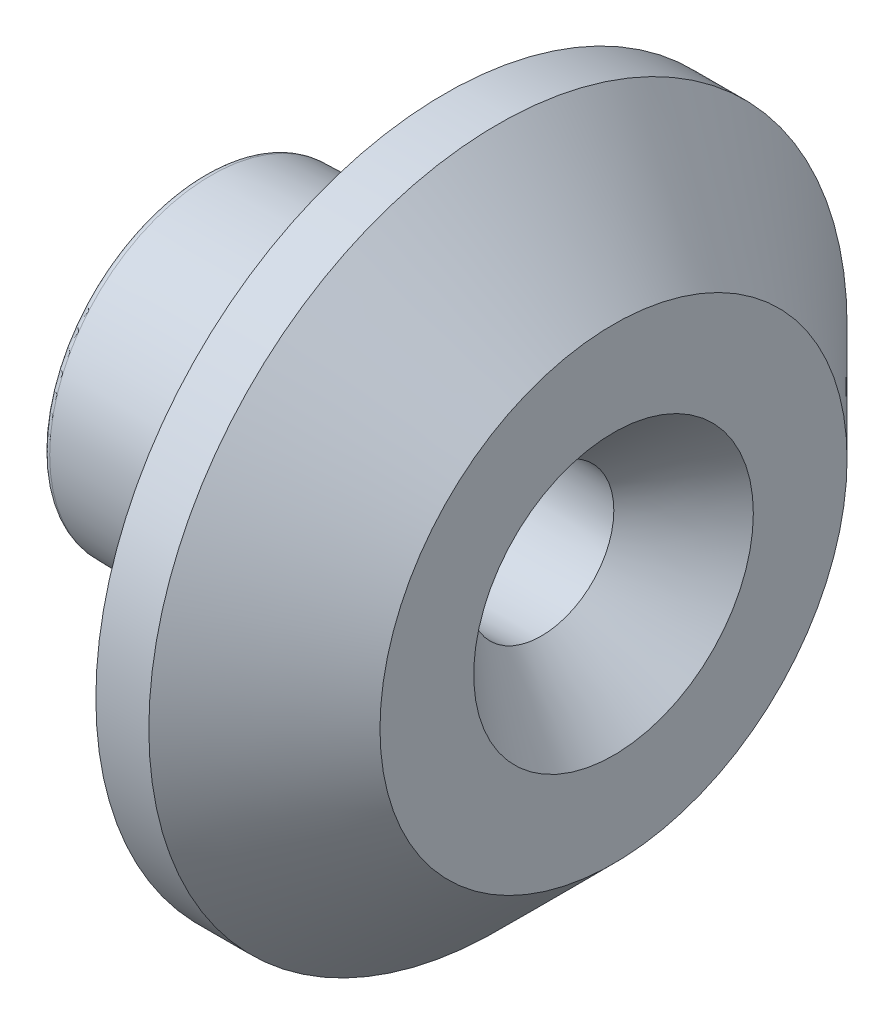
ISO-10303-21;
HEADER;
FILE_DESCRIPTION(('STEP AP214'),'2;1');
FILE_NAME('part.step','',(''),(''),'','','');
FILE_SCHEMA(('AUTOMOTIVE_DESIGN { 1 0 10303 214 1 1 1 1 }'));
ENDSEC;
DATA;
#1=APPLICATION_CONTEXT('core data for automotive mechanical design processes');
#2=APPLICATION_PROTOCOL_DEFINITION('international standard','automotive_design',2000,#1);
#3=PRODUCT_CONTEXT('',#1,'mechanical');
#4=PRODUCT('Part','Part','',(#3));
#5=PRODUCT_RELATED_PRODUCT_CATEGORY('part','',(#4));
#6=PRODUCT_DEFINITION_FORMATION('','',#4);
#7=PRODUCT_DEFINITION_CONTEXT('part definition',#1,'design');
#8=PRODUCT_DEFINITION('design','',#6,#7);
#9=PRODUCT_DEFINITION_SHAPE('','',#8);
#10=(LENGTH_UNIT() NAMED_UNIT(*) SI_UNIT(.MILLI.,.METRE.));
#11=(NAMED_UNIT(*) PLANE_ANGLE_UNIT() SI_UNIT($,.RADIAN.));
#12=(NAMED_UNIT(*) SI_UNIT($,.STERADIAN.) SOLID_ANGLE_UNIT());
#13=UNCERTAINTY_MEASURE_WITH_UNIT(LENGTH_MEASURE(1.E-05),#10,'distance_accuracy_value','');
#14=(GEOMETRIC_REPRESENTATION_CONTEXT(3) GLOBAL_UNCERTAINTY_ASSIGNED_CONTEXT((#13)) GLOBAL_UNIT_ASSIGNED_CONTEXT((#10,
#11,#12)) REPRESENTATION_CONTEXT('',''));
#15=CARTESIAN_POINT('',(0.,0.,0.));
#16=DIRECTION('',(0.,0.,1.));
#17=DIRECTION('',(1.,0.,0.));
#18=AXIS2_PLACEMENT_3D('',#15,#16,#17);
#19=CARTESIAN_POINT('',(0.,7.105,0.));
#20=DIRECTION('',(1.,0.,0.));
#21=DIRECTION('',(0.,0.,-1.));
#22=AXIS2_PLACEMENT_3D('',#19,#20,#21);
#23=PLANE('',#22);
#24=CARTESIAN_POINT('',(0.,0.,0.));
#25=DIRECTION('',(-1.,0.,0.));
#26=DIRECTION('',(0.,0.,1.));
#27=AXIS2_PLACEMENT_3D('',#24,#25,#26);
#28=CIRCLE('',#27,14.7175);
#29=CARTESIAN_POINT('',(0.,0.,14.7175));
#30=VERTEX_POINT('',#29);
#31=EDGE_CURVE('E69',#30,#30,#28,.T.);
#32=ORIENTED_EDGE('',*,*,#31,.T.);
#33=EDGE_LOOP('',(#32));
#34=FACE_BOUND('',#33,.T.);
#35=CARTESIAN_POINT('',(0.,0.,0.));
#36=DIRECTION('',(-1.,0.,0.));
#37=DIRECTION('',(0.,0.,1.));
#38=AXIS2_PLACEMENT_3D('',#35,#36,#37);
#39=CIRCLE('',#38,12.18);
#40=CARTESIAN_POINT('',(0.,0.,12.18));
#41=VERTEX_POINT('',#40);
#42=EDGE_CURVE('E78',#41,#41,#39,.T.);
#43=ORIENTED_EDGE('',*,*,#42,.F.);
#44=EDGE_LOOP('',(#43));
#45=FACE_BOUND('',#44,.T.);
#46=ADVANCED_FACE('F31',(#34,#45),#23,.F.);
#47=CARTESIAN_POINT('',(-65.7098157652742,0.,0.));
#48=DIRECTION('',(-1.,0.,0.));
#49=DIRECTION('',(0.,0.,1.));
#50=AXIS2_PLACEMENT_3D('',#47,#48,#49);
#51=CYLINDRICAL_SURFACE('',#50,14.7175);
#52=ORIENTED_EDGE('',*,*,#31,.F.);
#53=EDGE_LOOP('',(#52));
#54=FACE_BOUND('',#53,.T.);
#55=CARTESIAN_POINT('',(2.23299999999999,0.,0.));
#56=DIRECTION('',(-1.,0.,0.));
#57=DIRECTION('',(0.,0.,1.));
#58=AXIS2_PLACEMENT_3D('',#55,#56,#57);
#59=CIRCLE('',#58,14.7175);
#60=CARTESIAN_POINT('',(2.23299999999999,0.,14.7175));
#61=VERTEX_POINT('',#60);
#62=EDGE_CURVE('E72',#61,#61,#59,.T.);
#63=ORIENTED_EDGE('',*,*,#62,.T.);
#64=EDGE_LOOP('',(#63));
#65=FACE_BOUND('',#64,.T.);
#66=ADVANCED_FACE('F104',(#54,#65),#51,.T.);
#67=CARTESIAN_POINT('',(7.10499999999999,0.,0.));
#68=DIRECTION('',(-1.,0.,0.));
#69=DIRECTION('',(0.,0.,1.));
#70=AXIS2_PLACEMENT_3D('',#67,#68,#69);
#71=CONICAL_SURFACE('',#70,9.84549999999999,0.78539816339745);
#72=ORIENTED_EDGE('',*,*,#62,.F.);
#73=EDGE_LOOP('',(#72));
#74=FACE_BOUND('',#73,.T.);
#75=CARTESIAN_POINT('',(7.10499999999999,0.,0.));
#76=DIRECTION('',(-1.,0.,0.));
#77=DIRECTION('',(0.,0.,1.));
#78=AXIS2_PLACEMENT_3D('',#75,#76,#77);
#79=CIRCLE('',#78,9.84549999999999);
#80=CARTESIAN_POINT('',(7.10499999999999,0.,9.84549999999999));
#81=VERTEX_POINT('',#80);
#82=EDGE_CURVE('E75',#81,#81,#79,.T.);
#83=ORIENTED_EDGE('',*,*,#82,.T.);
#84=EDGE_LOOP('',(#83));
#85=FACE_BOUND('',#84,.T.);
#86=ADVANCED_FACE('F110',(#74,#85),#71,.T.);
#87=CARTESIAN_POINT('',(7.105,9.84549999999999,0.));
#88=DIRECTION('',(-1.,0.,0.));
#89=DIRECTION('',(0.,0.,1.));
#90=AXIS2_PLACEMENT_3D('',#87,#88,#89);
#91=PLANE('',#90);
#92=CARTESIAN_POINT('',(7.105,0.,0.));
#93=DIRECTION('',(-1.,0.,0.));
#94=DIRECTION('',(0.,0.,1.));
#95=AXIS2_PLACEMENT_3D('',#92,#93,#94);
#96=CIRCLE('',#95,5.89398977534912);
#97=CARTESIAN_POINT('',(7.105,0.,-5.89398977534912));
#98=VERTEX_POINT('',#97);
#99=EDGE_CURVE('E38',#98,#98,#96,.T.);
#100=ORIENTED_EDGE('',*,*,#99,.T.);
#101=EDGE_LOOP('',(#100));
#102=FACE_BOUND('',#101,.T.);
#103=ORIENTED_EDGE('',*,*,#82,.F.);
#104=EDGE_LOOP('',(#103));
#105=FACE_BOUND('',#104,.T.);
#106=ADVANCED_FACE('F187',(#102,#105),#91,.F.);
#107=CARTESIAN_POINT('',(-54.0194689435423,0.,0.));
#108=DIRECTION('',(-1.,0.,0.));
#109=DIRECTION('',(0.,0.,1.));
#110=AXIS2_PLACEMENT_3D('',#107,#108,#109);
#111=CYLINDRICAL_SURFACE('',#110,12.18);
#112=CARTESIAN_POINT('',(1.7255,0.,0.));
#113=DIRECTION('',(-1.,0.,0.));
#114=DIRECTION('',(0.,0.,1.));
#115=AXIS2_PLACEMENT_3D('',#112,#113,#114);
#116=CIRCLE('',#115,12.18);
#117=CARTESIAN_POINT('',(1.7255,0.,12.18));
#118=VERTEX_POINT('',#117);
#119=EDGE_CURVE('E51',#118,#118,#116,.F.);
#120=ORIENTED_EDGE('',*,*,#119,.T.);
#121=EDGE_LOOP('',(#120));
#122=FACE_BOUND('',#121,.T.);
#123=ORIENTED_EDGE('',*,*,#42,.T.);
#124=EDGE_LOOP('',(#123));
#125=FACE_BOUND('',#124,.T.);
#126=ADVANCED_FACE('F99',(#122,#125),#111,.F.);
#127=CARTESIAN_POINT('',(2.03,7.105,0.));
#128=DIRECTION('',(-1.,0.,0.));
#129=DIRECTION('',(0.,0.,1.));
#130=AXIS2_PLACEMENT_3D('',#127,#128,#129);
#131=PLANE('',#130);
#132=CARTESIAN_POINT('',(2.03,0.,0.));
#133=DIRECTION('',(-1.,0.,0.));
#134=DIRECTION('',(0.,0.,1.));
#135=AXIS2_PLACEMENT_3D('',#132,#133,#134);
#136=CIRCLE('',#135,7.4095);
#137=CARTESIAN_POINT('',(2.03,0.,7.4095));
#138=VERTEX_POINT('',#137);
#139=EDGE_CURVE('E54',#138,#138,#136,.F.);
#140=ORIENTED_EDGE('',*,*,#139,.T.);
#141=EDGE_LOOP('',(#140));
#142=FACE_BOUND('',#141,.T.);
#143=CARTESIAN_POINT('',(2.03,0.,0.));
#144=DIRECTION('',(-1.,0.,0.));
#145=DIRECTION('',(0.,0.,1.));
#146=AXIS2_PLACEMENT_3D('',#143,#144,#145);
#147=CIRCLE('',#146,11.8755);
#148=CARTESIAN_POINT('',(2.03,0.,11.8755));
#149=VERTEX_POINT('',#148);
#150=EDGE_CURVE('E57',#149,#149,#147,.T.);
#151=ORIENTED_EDGE('',*,*,#150,.T.);
#152=EDGE_LOOP('',(#151));
#153=FACE_BOUND('',#152,.T.);
#154=ADVANCED_FACE('F90',(#142,#153),#131,.T.);
#155=CARTESIAN_POINT('',(-54.0194689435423,0.,0.));
#156=DIRECTION('',(-1.,0.,0.));
#157=DIRECTION('',(0.,0.,1.));
#158=AXIS2_PLACEMENT_3D('',#155,#156,#157);
#159=CYLINDRICAL_SURFACE('',#158,7.105);
#160=CARTESIAN_POINT('',(1.7255,0.,0.));
#161=DIRECTION('',(-1.,0.,0.));
#162=DIRECTION('',(0.,0.,1.));
#163=AXIS2_PLACEMENT_3D('',#160,#161,#162);
#164=CIRCLE('',#163,7.105);
#165=CARTESIAN_POINT('',(1.7255,0.,7.105));
#166=VERTEX_POINT('',#165);
#167=EDGE_CURVE('E60',#166,#166,#164,.T.);
#168=ORIENTED_EDGE('',*,*,#167,.T.);
#169=EDGE_LOOP('',(#168));
#170=FACE_BOUND('',#169,.T.);
#171=CARTESIAN_POINT('',(0.,0.,0.));
#172=DIRECTION('',(-1.,0.,0.));
#173=DIRECTION('',(0.,0.,1.));
#174=AXIS2_PLACEMENT_3D('',#171,#172,#173);
#175=CIRCLE('',#174,7.105);
#176=CARTESIAN_POINT('',(0.,0.,7.105));
#177=VERTEX_POINT('',#176);
#178=EDGE_CURVE('E81',#177,#177,#175,.T.);
#179=ORIENTED_EDGE('',*,*,#178,.F.);
#180=EDGE_LOOP('',(#179));
#181=FACE_BOUND('',#180,.T.);
#182=ADVANCED_FACE('F87',(#170,#181),#159,.T.);
#183=CARTESIAN_POINT('',(-10.15,0.,0.));
#184=DIRECTION('',(1.,0.,0.));
#185=DIRECTION('',(0.,0.,-1.));
#186=AXIS2_PLACEMENT_3D('',#183,#184,#185);
#187=PLANE('',#186);
#188=CARTESIAN_POINT('',(-10.15,0.,0.));
#189=DIRECTION('',(1.,0.,0.));
#190=DIRECTION('',(0.,0.,-1.));
#191=AXIS2_PLACEMENT_3D('',#188,#189,#190);
#192=CIRCLE('',#191,3.74853482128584);
#193=CARTESIAN_POINT('',(-10.15,0.,-3.74853482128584));
#194=VERTEX_POINT('',#193);
#195=EDGE_CURVE('E42',#194,#194,#192,.T.);
#196=ORIENTED_EDGE('',*,*,#195,.T.);
#197=EDGE_LOOP('',(#196));
#198=FACE_BOUND('',#197,.T.);
#199=CARTESIAN_POINT('',(-10.15,0.,0.));
#200=DIRECTION('',(1.,0.,0.));
#201=DIRECTION('',(0.,0.,-1.));
#202=AXIS2_PLACEMENT_3D('',#199,#200,#201);
#203=CIRCLE('',#202,6.50499800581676);
#204=CARTESIAN_POINT('',(-10.15,0.,-6.50499800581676));
#205=VERTEX_POINT('',#204);
#206=EDGE_CURVE('E66',#205,#205,#203,.F.);
#207=ORIENTED_EDGE('',*,*,#206,.T.);
#208=EDGE_LOOP('',(#207));
#209=FACE_BOUND('',#208,.T.);
#210=ADVANCED_FACE('F89',(#198,#209),#187,.F.);
#211=CARTESIAN_POINT('',(0.,0.,0.));
#212=DIRECTION('',(1.,0.,0.));
#213=DIRECTION('',(0.,0.,-1.));
#214=AXIS2_PLACEMENT_3D('',#211,#212,#213);
#215=CONICAL_SURFACE('',#214,7.105,0.0299910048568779);
#216=CARTESIAN_POINT('',(-9.85463089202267,0.,0.));
#217=DIRECTION('',(-1.,0.,0.));
#218=DIRECTION('',(0.,0.,1.));
#219=AXIS2_PLACEMENT_3D('',#216,#217,#218);
#220=CIRCLE('',#219,6.80936107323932);
#221=CARTESIAN_POINT('',(-9.85463089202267,0.,6.80936107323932));
#222=VERTEX_POINT('',#221);
#223=EDGE_CURVE('E63',#222,#222,#220,.F.);
#224=ORIENTED_EDGE('',*,*,#223,.T.);
#225=EDGE_LOOP('',(#224));
#226=FACE_BOUND('',#225,.T.);
#227=ORIENTED_EDGE('',*,*,#178,.T.);
#228=EDGE_LOOP('',(#227));
#229=FACE_BOUND('',#228,.T.);
#230=ADVANCED_FACE('F85',(#226,#229),#215,.T.);
#231=CARTESIAN_POINT('',(-9.8455,0.,0.));
#232=DIRECTION('',(1.,0.,0.));
#233=DIRECTION('',(0.,0.,-1.));
#234=AXIS2_PLACEMENT_3D('',#231,#232,#233);
#235=TOROIDAL_SURFACE('',#234,6.50499800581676,0.3045);
#236=ORIENTED_EDGE('',*,*,#223,.F.);
#237=EDGE_LOOP('',(#236));
#238=FACE_BOUND('',#237,.T.);
#239=ORIENTED_EDGE('',*,*,#206,.F.);
#240=EDGE_LOOP('',(#239));
#241=FACE_BOUND('',#240,.T.);
#242=ADVANCED_FACE('F117',(#238,#241),#235,.T.);
#243=CARTESIAN_POINT('',(1.7255,0.,0.));
#244=DIRECTION('',(-1.,0.,0.));
#245=DIRECTION('',(0.,0.,1.));
#246=AXIS2_PLACEMENT_3D('',#243,#244,#245);
#247=TOROIDAL_SURFACE('',#246,7.4095,0.3045);
#248=ORIENTED_EDGE('',*,*,#139,.F.);
#249=EDGE_LOOP('',(#248));
#250=FACE_BOUND('',#249,.T.);
#251=ORIENTED_EDGE('',*,*,#167,.F.);
#252=EDGE_LOOP('',(#251));
#253=FACE_BOUND('',#252,.T.);
#254=ADVANCED_FACE('F122',(#250,#253),#247,.F.);
#255=CARTESIAN_POINT('',(1.7255,0.,0.));
#256=DIRECTION('',(-1.,0.,0.));
#257=DIRECTION('',(0.,0.,1.));
#258=AXIS2_PLACEMENT_3D('',#255,#256,#257);
#259=TOROIDAL_SURFACE('',#258,11.8755,0.3045);
#260=ORIENTED_EDGE('',*,*,#119,.F.);
#261=EDGE_LOOP('',(#260));
#262=FACE_BOUND('',#261,.T.);
#263=ORIENTED_EDGE('',*,*,#150,.F.);
#264=EDGE_LOOP('',(#263));
#265=FACE_BOUND('',#264,.T.);
#266=ADVANCED_FACE('F126',(#262,#265),#259,.F.);
#267=CARTESIAN_POINT('',(-10.15,0.,0.));
#268=DIRECTION('',(-1.,0.,0.));
#269=DIRECTION('',(0.,0.,1.));
#270=AXIS2_PLACEMENT_3D('',#267,#268,#269);
#271=CONICAL_SURFACE('',#270,3.5525,0.0349065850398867);
#272=CARTESIAN_POINT('',(4.06185493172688,0.,0.));
#273=DIRECTION('',(1.,0.,0.));
#274=DIRECTION('',(0.,0.,-1.));
#275=AXIS2_PLACEMENT_3D('',#272,#273,#274);
#276=CIRCLE('',#275,3.05621108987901);
#277=CARTESIAN_POINT('',(4.06185493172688,0.,-3.05621108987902));
#278=VERTEX_POINT('',#277);
#279=EDGE_CURVE('E10',#278,#278,#276,.T.);
#280=ORIENTED_EDGE('',*,*,#279,.T.);
#281=EDGE_LOOP('',(#280));
#282=FACE_BOUND('',#281,.T.);
#283=CARTESIAN_POINT('',(-9.95408459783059,0.,0.));
#284=DIRECTION('',(1.,0.,0.));
#285=DIRECTION('',(0.,0.,-1.));
#286=AXIS2_PLACEMENT_3D('',#283,#284,#285);
#287=CIRCLE('',#286,3.54565848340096);
#288=CARTESIAN_POINT('',(-9.95408459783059,0.,-3.54565848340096));
#289=VERTEX_POINT('',#288);
#290=EDGE_CURVE('E46',#289,#289,#287,.F.);
#291=ORIENTED_EDGE('',*,*,#290,.T.);
#292=EDGE_LOOP('',(#291));
#293=FACE_BOUND('',#292,.T.);
#294=ADVANCED_FACE('F129',(#282,#293),#271,.F.);
#295=CARTESIAN_POINT('',(-9.947,0.,0.));
#296=DIRECTION('',(1.,0.,0.));
#297=DIRECTION('',(0.,0.,-1.));
#298=AXIS2_PLACEMENT_3D('',#295,#296,#297);
#299=TOROIDAL_SURFACE('',#298,3.74853482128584,0.203);
#300=ORIENTED_EDGE('',*,*,#195,.F.);
#301=EDGE_LOOP('',(#300));
#302=FACE_BOUND('',#301,.T.);
#303=ORIENTED_EDGE('',*,*,#290,.F.);
#304=EDGE_LOOP('',(#303));
#305=FACE_BOUND('',#304,.T.);
#306=ADVANCED_FACE('F131',(#302,#305),#299,.T.);
#307=CARTESIAN_POINT('',(7.105,0.,0.));
#308=DIRECTION('',(1.,0.,0.));
#309=DIRECTION('',(0.,0.,-1.));
#310=AXIS2_PLACEMENT_3D('',#307,#308,#309);
#311=CONICAL_SURFACE('',#310,5.89398977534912,0.75049157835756);
#312=CARTESIAN_POINT('',(4.06185493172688,0.,-3.05621108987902));
#313=CARTESIAN_POINT('',(4.09355435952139,0.,-3.08577128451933));
#314=CARTESIAN_POINT('',(4.1252537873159,0.,-3.11533147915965));
#315=CARTESIAN_POINT('',(4.18865264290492,0.,-3.17445186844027));
#316=CARTESIAN_POINT('',(4.22035207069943,0.,-3.20401206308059));
#317=CARTESIAN_POINT('',(4.28375092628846,0.,-3.26313245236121));
#318=CARTESIAN_POINT('',(4.31545035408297,0.,-3.29269264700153));
#319=CARTESIAN_POINT('',(4.37884920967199,0.,-3.35181303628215));
#320=CARTESIAN_POINT('',(4.4105486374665,0.,-3.38137323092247));
#321=CARTESIAN_POINT('',(4.47394749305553,0.,-3.4404936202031));
#322=CARTESIAN_POINT('',(4.50564692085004,0.,-3.47005381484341));
#323=CARTESIAN_POINT('',(4.56904577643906,0.,-3.52917420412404));
#324=CARTESIAN_POINT('',(4.60074520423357,0.,-3.55873439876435));
#325=CARTESIAN_POINT('',(4.6641440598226,0.,-3.61785478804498));
#326=CARTESIAN_POINT('',(4.69584348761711,0.,-3.64741498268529));
#327=CARTESIAN_POINT('',(4.75924234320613,0.,-3.70653537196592));
#328=CARTESIAN_POINT('',(4.79094177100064,0.,-3.73609556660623));
#329=CARTESIAN_POINT('',(4.85434062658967,0.,-3.79521595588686));
#330=CARTESIAN_POINT('',(4.88604005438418,0.,-3.82477615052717));
#331=CARTESIAN_POINT('',(4.9494389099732,0.,-3.8838965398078));
#332=CARTESIAN_POINT('',(4.98113833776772,0.,-3.91345673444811));
#333=CARTESIAN_POINT('',(5.04453719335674,0.,-3.97257712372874));
#334=CARTESIAN_POINT('',(5.07623662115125,0.,-4.00213731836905));
#335=CARTESIAN_POINT('',(5.13963547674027,0.,-4.06125770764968));
#336=CARTESIAN_POINT('',(5.17133490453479,0.,-4.09081790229));
#337=CARTESIAN_POINT('',(5.23473376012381,0.,-4.14993829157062));
#338=CARTESIAN_POINT('',(5.26643318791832,0.,-4.17949848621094));
#339=CARTESIAN_POINT('',(5.32983204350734,0.,-4.23861887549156));
#340=CARTESIAN_POINT('',(5.36153147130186,0.,-4.26817907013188));
#341=CARTESIAN_POINT('',(5.42493032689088,0.,-4.3272994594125));
#342=CARTESIAN_POINT('',(5.45662975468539,0.,-4.35685965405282));
#343=CARTESIAN_POINT('',(5.52002861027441,0.,-4.41598004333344));
#344=CARTESIAN_POINT('',(5.55172803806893,0.,-4.44554023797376));
#345=CARTESIAN_POINT('',(5.61512689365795,0.,-4.50466062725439));
#346=CARTESIAN_POINT('',(5.64682632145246,0.,-4.5342208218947));
#347=CARTESIAN_POINT('',(5.71022517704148,0.,-4.59334121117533));
#348=CARTESIAN_POINT('',(5.741924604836,0.,-4.62290140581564));
#349=CARTESIAN_POINT('',(5.80532346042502,0.,-4.68202179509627));
#350=CARTESIAN_POINT('',(5.83702288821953,0.,-4.71158198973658));
#351=CARTESIAN_POINT('',(5.90042174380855,0.,-4.77070237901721));
#352=CARTESIAN_POINT('',(5.93212117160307,0.,-4.80026257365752));
#353=CARTESIAN_POINT('',(5.99552002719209,0.,-4.85938296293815));
#354=CARTESIAN_POINT('',(6.0272194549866,0.,-4.88894315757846));
#355=CARTESIAN_POINT('',(6.09061831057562,0.,-4.94806354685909));
#356=CARTESIAN_POINT('',(6.12231773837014,0.,-4.9776237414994));
#357=CARTESIAN_POINT('',(6.18571659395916,0.,-5.03674413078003));
#358=CARTESIAN_POINT('',(6.21741602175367,0.,-5.06630432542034));
#359=CARTESIAN_POINT('',(6.28081487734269,0.,-5.12542471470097));
#360=CARTESIAN_POINT('',(6.31251430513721,0.,-5.15498490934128));
#361=CARTESIAN_POINT('',(6.37591316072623,0.,-5.21410529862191));
#362=CARTESIAN_POINT('',(6.40761258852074,0.,-5.24366549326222));
#363=CARTESIAN_POINT('',(6.47101144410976,0.,-5.30278588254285));
#364=CARTESIAN_POINT('',(6.50271087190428,0.,-5.33234607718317));
#365=CARTESIAN_POINT('',(6.5661097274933,0.,-5.39146646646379));
#366=CARTESIAN_POINT('',(6.59780915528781,0.,-5.42102666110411));
#367=CARTESIAN_POINT('',(6.66120801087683,0.,-5.48014705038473));
#368=CARTESIAN_POINT('',(6.69290743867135,0.,-5.50970724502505));
#369=CARTESIAN_POINT('',(6.75630629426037,0.,-5.56882763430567));
#370=CARTESIAN_POINT('',(6.78800572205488,0.,-5.59838782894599));
#371=CARTESIAN_POINT('',(6.85140457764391,0.,-5.65750821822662));
#372=CARTESIAN_POINT('',(6.88310400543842,0.,-5.68706841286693));
#373=CARTESIAN_POINT('',(6.94650286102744,0.,-5.74618880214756));
#374=CARTESIAN_POINT('',(6.97820228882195,0.,-5.77574899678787));
#375=CARTESIAN_POINT('',(7.04160114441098,0.,-5.8348693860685));
#376=CARTESIAN_POINT('',(7.07330057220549,0.,-5.86442958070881));
#377=CARTESIAN_POINT('',(7.105,0.,-5.89398977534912));
#378=B_SPLINE_CURVE_WITH_KNOTS('',3,(#312,#313,#314,#315,#316,#317,#318,#319,#320,#321,#322,
#323,#324,#325,#326,#327,#328,#329,#330,#331,#332,#333,#334,#335,#336,#337,#338,#339,#340,#341,
#342,#343,#344,#345,#346,#347,#348,#349,#350,#351,#352,#353,#354,#355,#356,#357,#358,#359,#360,
#361,#362,#363,#364,#365,#366,#367,#368,#369,#370,#371,#372,#373,#374,#375,#376,#377),
.UNSPECIFIED.,.F.,.F.,(4,2,2,2,2,2,2,2,2,2,2,2,2,2,2,2,2,2,2,2,2,2,2,2,2,2,2,2,2,2,2,2,4),(0.,
0.130030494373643,0.260060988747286,0.39009148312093,0.520121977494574,0.650152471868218,
0.780182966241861,0.910213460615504,1.04024395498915,1.17027444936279,1.30030494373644,
1.43033543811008,1.56036593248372,1.69039642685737,1.82042692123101,1.95045741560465,
2.0804879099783,2.21051840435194,2.34054889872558,2.47057939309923,2.60060988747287,
2.73064038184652,2.86067087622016,2.9907013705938,3.12073186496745,3.25076235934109,
3.38079285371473,3.51082334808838,3.64085384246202,3.77088433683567,3.90091483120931,
4.03094532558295,4.1609758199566),.UNSPECIFIED.);
#379=EDGE_CURVE('BSEAM33',#278,#98,#378,.T.);
#380=ORIENTED_EDGE('',*,*,#279,.F.);
#381=ORIENTED_EDGE('',*,*,#99,.F.);
#382=ORIENTED_EDGE('',*,*,#379,.T.);
#383=ORIENTED_EDGE('',*,*,#379,.F.);
#384=EDGE_LOOP('',(#380,#382,#381,#383));
#385=FACE_BOUND('',#384,.T.);
#386=ADVANCED_FACE('F33',(#385),#311,.F.);
#387=CLOSED_SHELL('',(#46,#66,#86,#106,#126,#154,#182,#210,#230,#242,#254,#266,#294,#306,#386));
#388=MANIFOLD_SOLID_BREP('B2',#387);
#389=ADVANCED_BREP_SHAPE_REPRESENTATION('',(#18,#388),#14);
#390=SHAPE_DEFINITION_REPRESENTATION(#9,#389);
ENDSEC;
END-ISO-10303-21;
